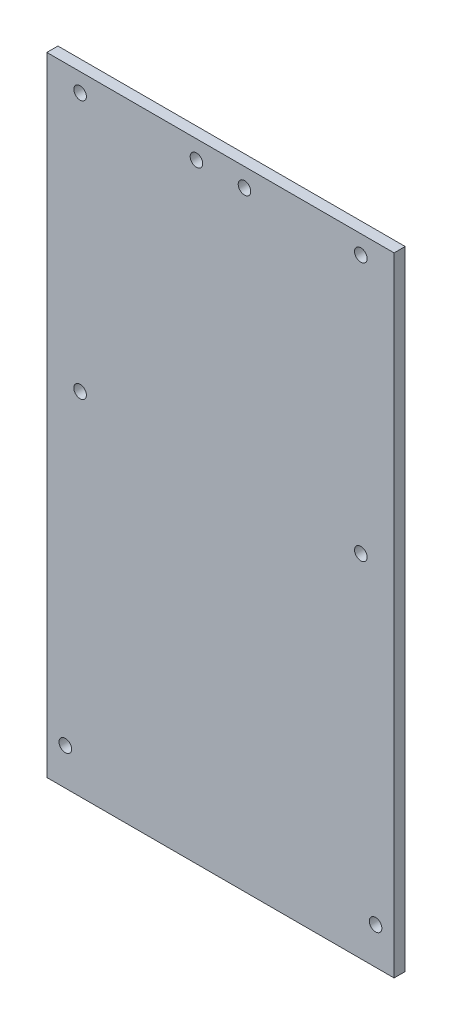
from build123d import *

# Parameters (mm, degrees)
SKETCH_1_W              = 94
SKETCH_1_H              = 170
EXTRUDE_1_DEPTH         = 3
HOLE_WIZARD_3_4_3_4_1_D = 3.4
HOLE_WIZARD_3_4_3_4_2_D = 3.4
HOLE_WIZARD_3_4_3_4_3_D = 3.4


with BuildPart() as part:
    # Sketch 1 → Extrude 1 (new body)
    with BuildSketch(Plane.XY):
        Rectangle(SKETCH_1_W, SKETCH_1_H)
    extrude(amount=EXTRUDE_1_DEPTH)

    # Hole Wizard 3.4 _3.4_ _1 (through all)
    with Locations(Plane(origin=(0, 0, 0), x_dir=(-1, 0, 0), z_dir=(0, 0, -1))):
        with Locations((-6.5, 80), (6.5, 80)):
            Hole(HOLE_WIZARD_3_4_3_4_1_D / 2)

    # Hole Wizard 3.4 _3.4_ _2 (through all)
    with Locations(Plane(origin=(0, 0, 0), x_dir=(-1, 0, 0), z_dir=(0, 0, -1))):
        with Locations((-42, -75), (42, -75)):
            Hole(HOLE_WIZARD_3_4_3_4_2_D / 2)

    # Hole Wizard 3.4 _3.4_ _3 (through all)
    with Locations(Plane(origin=(0, 0, 0), x_dir=(-1, 0, 0), z_dir=(0, 0, -1))):
        with Locations((-38, 80), (38, 80), (38, 10), (-38, 10)):
            Hole(HOLE_WIZARD_3_4_3_4_3_D / 2)


solid = part.part
